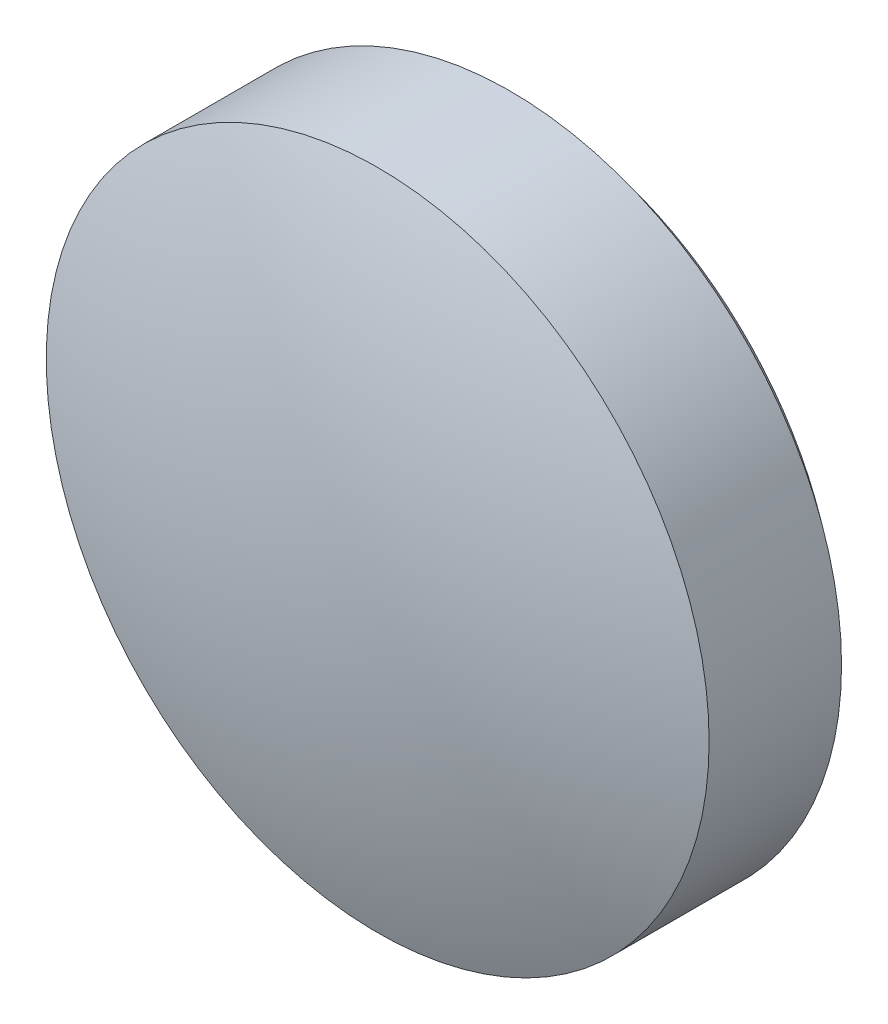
from build123d import *

# Parameters (mm, degrees)
SKETCH1_R           = 17
BOSS_EXTRUDE1_DEPTH = 6.7923


with BuildPart() as part:
    # Sketch1 → Boss-Extrude1 (new body)
    with BuildSketch(Plane.XY):
        Circle(SKETCH1_R)
    extrude(amount=BOSS_EXTRUDE1_DEPTH)

    # Sketch2 → Revolve1 (revolve)
    with BuildSketch(Plane(origin=(0, 0, 0), x_dir=(1, 0, 0), z_dir=(0, 1, 0))):
        with BuildLine():
            Line((17, 0), (0, 0))
            Line((0, 0), (0, 6.117651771))
            ThreePointArc((0, 6.117651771), (9.033626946, 4.541691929), (17, 0))
        make_face()
    revolve(axis=Axis((0, 0, 0), (0, 0, -1)))

    # Sketch3 → Revolve2 (revolve)
    with BuildSketch(Plane(origin=(0, 0, 0), x_dir=(1, 0, 0), z_dir=(0, 1, 0))):
        with BuildLine():
            Line((17, -6.7923), (0, -6.7923))
            Line((0, -6.7923), (0, -9.885361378))
            ThreePointArc((0, -9.885361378), (8.639546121, -9.10580029), (17, -6.7923))
        make_face()
    revolve(axis=Axis((0, 0, 6.7923), (0, 0, 1)))


solid = part.part
